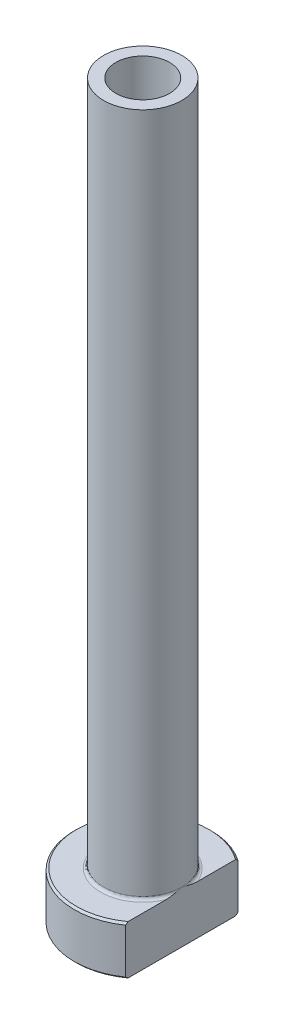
ISO-10303-21;
HEADER;
FILE_DESCRIPTION(('STEP AP214'),'2;1');
FILE_NAME('part.step','',(''),(''),'','','');
FILE_SCHEMA(('AUTOMOTIVE_DESIGN { 1 0 10303 214 1 1 1 1 }'));
ENDSEC;
DATA;
#1=APPLICATION_CONTEXT('core data for automotive mechanical design processes');
#2=APPLICATION_PROTOCOL_DEFINITION('international standard','automotive_design',2000,#1);
#3=PRODUCT_CONTEXT('',#1,'mechanical');
#4=PRODUCT('Part','Part','',(#3));
#5=PRODUCT_RELATED_PRODUCT_CATEGORY('part','',(#4));
#6=PRODUCT_DEFINITION_FORMATION('','',#4);
#7=PRODUCT_DEFINITION_CONTEXT('part definition',#1,'design');
#8=PRODUCT_DEFINITION('design','',#6,#7);
#9=PRODUCT_DEFINITION_SHAPE('','',#8);
#10=(LENGTH_UNIT() NAMED_UNIT(*) SI_UNIT(.MILLI.,.METRE.));
#11=(NAMED_UNIT(*) PLANE_ANGLE_UNIT() SI_UNIT($,.RADIAN.));
#12=(NAMED_UNIT(*) SI_UNIT($,.STERADIAN.) SOLID_ANGLE_UNIT());
#13=UNCERTAINTY_MEASURE_WITH_UNIT(LENGTH_MEASURE(1.E-05),#10,'distance_accuracy_value','');
#14=(GEOMETRIC_REPRESENTATION_CONTEXT(3) GLOBAL_UNCERTAINTY_ASSIGNED_CONTEXT((#13)) GLOBAL_UNIT_ASSIGNED_CONTEXT((#10,
#11,#12)) REPRESENTATION_CONTEXT('',''));
#15=CARTESIAN_POINT('',(0.,0.,0.));
#16=DIRECTION('',(0.,0.,1.));
#17=DIRECTION('',(1.,0.,0.));
#18=AXIS2_PLACEMENT_3D('',#15,#16,#17);
#19=CARTESIAN_POINT('',(0.,92.1876809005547,0.));
#20=DIRECTION('',(0.,1.,0.));
#21=DIRECTION('',(0.,0.,1.));
#22=AXIS2_PLACEMENT_3D('',#19,#20,#21);
#23=CYLINDRICAL_SURFACE('',#22,2.75000000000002);
#24=CARTESIAN_POINT('',(0.,75.,0.));
#25=DIRECTION('',(0.,1.,0.));
#26=DIRECTION('',(0.,0.,1.));
#27=AXIS2_PLACEMENT_3D('',#24,#25,#26);
#28=CIRCLE('',#27,2.75000000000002);
#29=CARTESIAN_POINT('',(0.,75.,2.75000000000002));
#30=VERTEX_POINT('',#29);
#31=EDGE_CURVE('E167',#30,#30,#28,.T.);
#32=ORIENTED_EDGE('',*,*,#31,.T.);
#33=EDGE_LOOP('',(#32));
#34=FACE_BOUND('',#33,.T.);
#35=CARTESIAN_POINT('',(0.,30.,0.));
#36=DIRECTION('',(0.,1.,0.));
#37=DIRECTION('',(0.,0.,1.));
#38=AXIS2_PLACEMENT_3D('',#35,#36,#37);
#39=CIRCLE('',#38,2.75000000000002);
#40=CARTESIAN_POINT('',(0.,30.,2.75000000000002));
#41=VERTEX_POINT('',#40);
#42=EDGE_CURVE('E170',#41,#41,#39,.T.);
#43=ORIENTED_EDGE('',*,*,#42,.F.);
#44=EDGE_LOOP('',(#43));
#45=FACE_BOUND('',#44,.T.);
#46=ADVANCED_FACE('F32',(#34,#45),#23,.F.);
#47=CARTESIAN_POINT('',(-2.75000000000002,75.,0.));
#48=DIRECTION('',(0.,1.,0.));
#49=DIRECTION('',(0.,0.,1.));
#50=AXIS2_PLACEMENT_3D('',#47,#48,#49);
#51=PLANE('',#50);
#52=CARTESIAN_POINT('',(0.,75.,0.));
#53=DIRECTION('',(0.,1.,0.));
#54=DIRECTION('',(0.,0.,1.));
#55=AXIS2_PLACEMENT_3D('',#52,#53,#54);
#56=CIRCLE('',#55,4.);
#57=CARTESIAN_POINT('',(0.,75.,4.));
#58=VERTEX_POINT('',#57);
#59=EDGE_CURVE('E174',#58,#58,#56,.T.);
#60=ORIENTED_EDGE('',*,*,#59,.T.);
#61=EDGE_LOOP('',(#60));
#62=FACE_BOUND('',#61,.T.);
#63=ORIENTED_EDGE('',*,*,#31,.F.);
#64=EDGE_LOOP('',(#63));
#65=FACE_BOUND('',#64,.T.);
#66=ADVANCED_FACE('F157',(#62,#65),#51,.T.);
#67=CARTESIAN_POINT('',(0.,92.1876809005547,0.));
#68=DIRECTION('',(0.,1.,0.));
#69=DIRECTION('',(0.,0.,1.));
#70=AXIS2_PLACEMENT_3D('',#67,#68,#69);
#71=CYLINDRICAL_SURFACE('',#70,3.99999999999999);
#72=CARTESIAN_POINT('',(0.,5.3,0.));
#73=DIRECTION('',(0.,1.,0.));
#74=DIRECTION('',(0.,0.,1.));
#75=AXIS2_PLACEMENT_3D('',#72,#73,#74);
#76=CIRCLE('',#75,3.99999999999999);
#77=CARTESIAN_POINT('',(3.99999999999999,5.3,0.));
#78=VERTEX_POINT('',#77);
#79=EDGE_CURVE('E180',#78,#78,#76,.T.);
#80=ORIENTED_EDGE('',*,*,#79,.T.);
#81=EDGE_LOOP('',(#80));
#82=FACE_BOUND('',#81,.T.);
#83=ORIENTED_EDGE('',*,*,#59,.F.);
#84=EDGE_LOOP('',(#83));
#85=FACE_BOUND('',#84,.T.);
#86=ADVANCED_FACE('F162',(#82,#85),#71,.T.);
#87=CARTESIAN_POINT('',(-3.99999999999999,5.,0.));
#88=DIRECTION('',(0.,1.,0.));
#89=DIRECTION('',(0.,0.,1.));
#90=AXIS2_PLACEMENT_3D('',#87,#88,#89);
#91=PLANE('',#90);
#92=DIRECTION('',(0.,0.,1.));
#93=VECTOR('',#92,1.);
#94=CARTESIAN_POINT('',(4.,5.,0.));
#95=LINE('',#94,#93);
#96=CARTESIAN_POINT('',(4.,5.,-5.49909083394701));
#97=VERTEX_POINT('',#96);
#98=CARTESIAN_POINT('',(4.,5.,-1.57797338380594));
#99=VERTEX_POINT('',#98);
#100=EDGE_CURVE('E54',#97,#99,#95,.T.);
#101=ORIENTED_EDGE('',*,*,#100,.F.);
#102=CARTESIAN_POINT('',(0.,5.,0.));
#103=DIRECTION('',(0.,1.,0.));
#104=DIRECTION('',(0.,0.,1.));
#105=AXIS2_PLACEMENT_3D('',#102,#103,#104);
#106=CIRCLE('',#105,6.8);
#107=CARTESIAN_POINT('',(3.99999999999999,5.,5.49909083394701));
#108=VERTEX_POINT('',#107);
#109=EDGE_CURVE('E186',#97,#108,#106,.T.);
#110=ORIENTED_EDGE('',*,*,#109,.T.);
#111=CARTESIAN_POINT('',(4.,5.,1.57797338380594));
#112=VERTEX_POINT('',#111);
#113=EDGE_CURVE('E134',#112,#108,#95,.T.);
#114=ORIENTED_EDGE('',*,*,#113,.F.);
#115=CARTESIAN_POINT('',(0.,5.,0.));
#116=DIRECTION('',(0.,1.,0.));
#117=DIRECTION('',(0.,0.,1.));
#118=AXIS2_PLACEMENT_3D('',#115,#116,#117);
#119=CIRCLE('',#118,4.29999999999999);
#120=EDGE_CURVE('E183',#112,#99,#119,.F.);
#121=ORIENTED_EDGE('',*,*,#120,.T.);
#122=EDGE_LOOP('',(#101,#110,#114,#121));
#123=FACE_BOUND('',#122,.T.);
#124=ADVANCED_FACE('F197',(#123),#91,.T.);
#125=CARTESIAN_POINT('',(0.,92.1876809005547,0.));
#126=DIRECTION('',(0.,1.,0.));
#127=DIRECTION('',(0.,0.,1.));
#128=AXIS2_PLACEMENT_3D('',#125,#126,#127);
#129=CYLINDRICAL_SURFACE('',#128,6.99999999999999);
#130=DIRECTION('',(0.,-1.,0.));
#131=VECTOR('',#130,1.);
#132=CARTESIAN_POINT('',(3.99999999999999,75.,5.74456264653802));
#133=LINE('',#132,#131);
#134=CARTESIAN_POINT('',(3.99999999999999,4.8,5.74456264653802));
#135=VERTEX_POINT('',#134);
#136=CARTESIAN_POINT('',(3.99999999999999,0.199999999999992,5.74456264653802));
#137=VERTEX_POINT('',#136);
#138=EDGE_CURVE('E82',#135,#137,#133,.T.);
#139=ORIENTED_EDGE('',*,*,#138,.F.);
#140=CARTESIAN_POINT('',(0.,4.8,0.));
#141=DIRECTION('',(0.,1.,0.));
#142=DIRECTION('',(0.,0.,1.));
#143=AXIS2_PLACEMENT_3D('',#140,#141,#142);
#144=CIRCLE('',#143,6.99999999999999);
#145=CARTESIAN_POINT('',(4.,4.8,-5.74456264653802));
#146=VERTEX_POINT('',#145);
#147=EDGE_CURVE('E95',#135,#146,#144,.F.);
#148=ORIENTED_EDGE('',*,*,#147,.T.);
#149=DIRECTION('',(0.,-1.,0.));
#150=VECTOR('',#149,1.);
#151=CARTESIAN_POINT('',(4.,75.,-5.74456264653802));
#152=LINE('',#151,#150);
#153=CARTESIAN_POINT('',(4.,0.199999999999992,-5.74456264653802));
#154=VERTEX_POINT('',#153);
#155=EDGE_CURVE('E192',#146,#154,#152,.T.);
#156=ORIENTED_EDGE('',*,*,#155,.T.);
#157=CARTESIAN_POINT('',(0.,0.199999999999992,0.));
#158=DIRECTION('',(0.,-1.,0.));
#159=DIRECTION('',(0.,0.,-1.));
#160=AXIS2_PLACEMENT_3D('',#157,#158,#159);
#161=CIRCLE('',#160,6.99999999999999);
#162=EDGE_CURVE('E98',#154,#137,#161,.F.);
#163=ORIENTED_EDGE('',*,*,#162,.T.);
#164=EDGE_LOOP('',(#139,#148,#156,#163));
#165=FACE_BOUND('',#164,.T.);
#166=ADVANCED_FACE('F190',(#165),#129,.T.);
#167=CARTESIAN_POINT('',(-6.99999999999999,0.,0.));
#168=DIRECTION('',(0.,-1.,0.));
#169=DIRECTION('',(0.,0.,-1.));
#170=AXIS2_PLACEMENT_3D('',#167,#168,#169);
#171=PLANE('',#170);
#172=CARTESIAN_POINT('',(0.,0.,0.));
#173=DIRECTION('',(0.,-1.,0.));
#174=DIRECTION('',(0.,0.,-1.));
#175=AXIS2_PLACEMENT_3D('',#172,#173,#174);
#176=CIRCLE('',#175,3.49999999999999);
#177=CARTESIAN_POINT('',(0.,0.,-3.49999999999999));
#178=VERTEX_POINT('',#177);
#179=EDGE_CURVE('E40',#178,#178,#176,.F.);
#180=ORIENTED_EDGE('',*,*,#179,.T.);
#181=EDGE_LOOP('',(#180));
#182=FACE_BOUND('',#181,.T.);
#183=DIRECTION('',(0.,0.,-1.));
#184=VECTOR('',#183,1.);
#185=CARTESIAN_POINT('',(3.99999999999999,0.,5.74456264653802));
#186=LINE('',#185,#184);
#187=CARTESIAN_POINT('',(3.99999999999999,0.,5.49909083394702));
#188=VERTEX_POINT('',#187);
#189=CARTESIAN_POINT('',(4.,0.,-5.49909083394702));
#190=VERTEX_POINT('',#189);
#191=EDGE_CURVE('E47',#188,#190,#186,.T.);
#192=ORIENTED_EDGE('',*,*,#191,.F.);
#193=CARTESIAN_POINT('',(0.,0.,0.));
#194=DIRECTION('',(0.,-1.,0.));
#195=DIRECTION('',(0.,0.,-1.));
#196=AXIS2_PLACEMENT_3D('',#193,#194,#195);
#197=CIRCLE('',#196,6.80000000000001);
#198=EDGE_CURVE('E92',#188,#190,#197,.T.);
#199=ORIENTED_EDGE('',*,*,#198,.T.);
#200=EDGE_LOOP('',(#192,#199));
#201=FACE_BOUND('',#200,.T.);
#202=ADVANCED_FACE('F91',(#182,#201),#171,.T.);
#203=CARTESIAN_POINT('',(0.,92.1876809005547,0.));
#204=DIRECTION('',(0.,1.,0.));
#205=DIRECTION('',(0.,0.,1.));
#206=AXIS2_PLACEMENT_3D('',#203,#204,#205);
#207=CYLINDRICAL_SURFACE('',#206,2.99999999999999);
#208=CARTESIAN_POINT('',(0.,0.5,0.));
#209=DIRECTION('',(0.,-1.,0.));
#210=DIRECTION('',(0.,0.,-1.));
#211=AXIS2_PLACEMENT_3D('',#208,#209,#210);
#212=CIRCLE('',#211,2.99999999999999);
#213=CARTESIAN_POINT('',(0.,0.5,-2.99999999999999));
#214=VERTEX_POINT('',#213);
#215=EDGE_CURVE('E11',#214,#214,#212,.T.);
#216=ORIENTED_EDGE('',*,*,#215,.T.);
#217=EDGE_LOOP('',(#216));
#218=FACE_BOUND('',#217,.T.);
#219=CARTESIAN_POINT('',(0.,18.,0.));
#220=DIRECTION('',(0.,1.,0.));
#221=DIRECTION('',(0.,0.,1.));
#222=AXIS2_PLACEMENT_3D('',#219,#220,#221);
#223=CIRCLE('',#222,2.99999999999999);
#224=CARTESIAN_POINT('',(0.,18.,2.99999999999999));
#225=VERTEX_POINT('',#224);
#226=EDGE_CURVE('E172',#225,#225,#223,.T.);
#227=ORIENTED_EDGE('',*,*,#226,.T.);
#228=EDGE_LOOP('',(#227));
#229=FACE_BOUND('',#228,.T.);
#230=ADVANCED_FACE('F215',(#218,#229),#207,.F.);
#231=CARTESIAN_POINT('',(0.,18.,0.));
#232=DIRECTION('',(0.,-1.,0.));
#233=DIRECTION('',(0.,0.,-1.));
#234=AXIS2_PLACEMENT_3D('',#231,#232,#233);
#235=CONICAL_SURFACE('',#234,2.99999999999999,0.0208303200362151);
#236=ORIENTED_EDGE('',*,*,#42,.T.);
#237=EDGE_LOOP('',(#236));
#238=FACE_BOUND('',#237,.T.);
#239=ORIENTED_EDGE('',*,*,#226,.F.);
#240=EDGE_LOOP('',(#239));
#241=FACE_BOUND('',#240,.T.);
#242=ADVANCED_FACE('F111',(#238,#241),#235,.F.);
#243=CARTESIAN_POINT('',(0.,5.3,0.));
#244=DIRECTION('',(0.,1.,0.));
#245=DIRECTION('',(0.,0.,1.));
#246=AXIS2_PLACEMENT_3D('',#243,#244,#245);
#247=TOROIDAL_SURFACE('',#246,4.29999999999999,0.3);
#248=ORIENTED_EDGE('',*,*,#120,.F.);
#249=CARTESIAN_POINT('',(3.99999999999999,5.3,0.));
#250=CARTESIAN_POINT('',(3.99999999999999,5.30000062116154,-1.06250692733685E-10));
#251=CARTESIAN_POINT('',(3.99999999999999,5.30000124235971,2.17725991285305E-07));
#252=CARTESIAN_POINT('',(3.99999999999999,5.30000240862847,8.36140834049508E-07));
#253=CARTESIAN_POINT('',(3.99999999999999,5.30000294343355,1.2501166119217E-06));
#254=CARTESIAN_POINT('',(3.99999999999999,5.3000040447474,2.23959309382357E-06));
#255=CARTESIAN_POINT('',(3.99999999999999,5.30000459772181,2.83084427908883E-06));
#256=CARTESIAN_POINT('',(3.99999999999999,5.30000559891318,4.06516564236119E-06));
#257=CARTESIAN_POINT('',(3.99999999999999,5.30000604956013,4.70640046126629E-06));
#258=CARTESIAN_POINT('',(3.99999999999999,5.30000769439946,7.15677144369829E-06));
#259=CARTESIAN_POINT('',(3.99999999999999,5.3000087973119,9.02995892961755E-06));
#260=CARTESIAN_POINT('',(3.99999999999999,5.30001063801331,1.27664878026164E-05));
#261=CARTESIAN_POINT('',(3.99999999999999,5.30001139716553,1.46197798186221E-05));
#262=CARTESIAN_POINT('',(3.99999999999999,5.3000145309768,2.23679207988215E-05));
#263=CARTESIAN_POINT('',(3.99999999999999,5.30001683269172,2.82968730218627E-05));
#264=CARTESIAN_POINT('',(3.99999999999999,5.30002027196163,3.95668707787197E-05));
#265=CARTESIAN_POINT('',(3.99999999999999,5.30002152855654,4.48715441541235E-05));
#266=CARTESIAN_POINT('',(3.99999999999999,5.30003060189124,8.40118167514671E-05));
#267=CARTESIAN_POINT('',(4.,5.30003739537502,0.000118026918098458));
#268=CARTESIAN_POINT('',(4.,5.30006713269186,0.000252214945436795));
#269=CARTESIAN_POINT('',(4.,5.30009559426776,0.000351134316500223));
#270=CARTESIAN_POINT('',(3.99999999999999,5.30020622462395,0.000742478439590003));
#271=CARTESIAN_POINT('',(3.99999999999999,5.30028475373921,0.00103561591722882));
#272=CARTESIAN_POINT('',(4.,5.3005988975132,0.0021992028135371));
#273=CARTESIAN_POINT('',(4.,5.30083905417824,0.0030687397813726));
#274=CARTESIAN_POINT('',(3.99999999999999,5.30183682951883,0.00669141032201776));
#275=CARTESIAN_POINT('',(3.99999999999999,5.30258877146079,0.00944568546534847));
#276=CARTESIAN_POINT('',(4.,5.31066890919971,0.0390293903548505));
#277=CARTESIAN_POINT('',(4.,5.31802631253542,0.0658531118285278));
#278=CARTESIAN_POINT('',(3.99999999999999,5.33239676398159,0.118441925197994));
#279=CARTESIAN_POINT('',(3.99999999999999,5.33941183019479,0.14420651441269));
#280=CARTESIAN_POINT('',(4.,5.35427366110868,0.199017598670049));
#281=CARTESIAN_POINT('',(4.,5.36211313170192,0.228066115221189));
#282=CARTESIAN_POINT('',(4.,5.37776349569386,0.28651184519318));
#283=CARTESIAN_POINT('',(4.,5.38557313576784,0.315909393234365));
#284=CARTESIAN_POINT('',(4.,5.40425662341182,0.386994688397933));
#285=CARTESIAN_POINT('',(4.,5.41505237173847,0.428703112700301));
#286=CARTESIAN_POINT('',(4.,5.43592310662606,0.511098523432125));
#287=CARTESIAN_POINT('',(4.,5.44600969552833,0.551782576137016));
#288=CARTESIAN_POINT('',(4.,5.47850986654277,0.686599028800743));
#289=CARTESIAN_POINT('',(4.,5.49978370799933,0.781011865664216));
#290=CARTESIAN_POINT('',(4.,5.53807543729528,0.971847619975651));
#291=CARTESIAN_POINT('',(4.,5.55504273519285,1.06828120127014));
#292=CARTESIAN_POINT('',(4.,5.57582405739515,1.21752725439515));
#293=CARTESIAN_POINT('',(4.,5.58209796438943,1.26999379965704));
#294=CARTESIAN_POINT('',(4.,5.59210686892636,1.37516324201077));
#295=CARTESIAN_POINT('',(4.,5.59584265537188,1.42786606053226));
#296=CARTESIAN_POINT('',(4.,5.60010438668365,1.53310673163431));
#297=CARTESIAN_POINT('',(4.,5.6006487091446,1.58564378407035));
#298=CARTESIAN_POINT('',(4.,5.59767158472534,1.69058605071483));
#299=CARTESIAN_POINT('',(4.,5.59415502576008,1.74299134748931));
#300=CARTESIAN_POINT('',(4.,5.58503062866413,1.8190329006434));
#301=CARTESIAN_POINT('',(4.,5.58157617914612,1.84292934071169));
#302=CARTESIAN_POINT('',(4.,5.5732995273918,1.89051061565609));
#303=CARTESIAN_POINT('',(4.,5.56847619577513,1.91419525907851));
#304=CARTESIAN_POINT('',(4.,5.55726644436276,1.96092888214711));
#305=CARTESIAN_POINT('',(4.,5.55089740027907,1.98398195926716));
#306=CARTESIAN_POINT('',(4.,5.53623434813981,2.0294555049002));
#307=CARTESIAN_POINT('',(4.,5.52794253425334,2.05187666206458));
#308=CARTESIAN_POINT('',(4.,5.50887098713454,2.09590631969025));
#309=CARTESIAN_POINT('',(4.,5.49806837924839,2.1175050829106));
#310=CARTESIAN_POINT('',(4.,5.47333401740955,2.15885583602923));
#311=CARTESIAN_POINT('',(4.,5.45941272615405,2.17861369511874));
#312=CARTESIAN_POINT('',(4.,5.43588221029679,2.20522942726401));
#313=CARTESIAN_POINT('',(4.,5.42781139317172,2.21344043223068));
#314=CARTESIAN_POINT('',(4.,5.41065114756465,2.22875149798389));
#315=CARTESIAN_POINT('',(4.,5.40156129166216,2.23585108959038));
#316=CARTESIAN_POINT('',(4.,5.38220524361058,2.24859694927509));
#317=CARTESIAN_POINT('',(4.,5.37192420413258,2.25422119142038));
#318=CARTESIAN_POINT('',(4.,5.35045072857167,2.26331064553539));
#319=CARTESIAN_POINT('',(4.,5.33926122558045,2.26678251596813));
#320=CARTESIAN_POINT('',(4.,5.31952044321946,2.27051268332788));
#321=CARTESIAN_POINT('',(4.,5.31108453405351,2.27139016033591));
#322=CARTESIAN_POINT('',(4.,5.29418624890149,2.2716896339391));
#323=CARTESIAN_POINT('',(4.,5.28572387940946,2.27111196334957));
#324=CARTESIAN_POINT('',(4.,5.26904138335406,2.26855580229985));
#325=CARTESIAN_POINT('',(4.,5.26082066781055,2.26658107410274));
#326=CARTESIAN_POINT('',(4.,5.24478214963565,2.26139496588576));
#327=CARTESIAN_POINT('',(4.,5.23696461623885,2.25818277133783));
#328=CARTESIAN_POINT('',(4.,5.21851235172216,2.24908332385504));
#329=CARTESIAN_POINT('',(4.,5.20815219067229,2.24264095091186));
#330=CARTESIAN_POINT('',(4.,5.18857975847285,2.22819957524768));
#331=CARTESIAN_POINT('',(4.,5.17937061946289,2.22019647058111));
#332=CARTESIAN_POINT('',(4.,5.15665383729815,2.19777756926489));
#333=CARTESIAN_POINT('',(4.,5.14403484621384,2.18246908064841));
#334=CARTESIAN_POINT('',(4.,5.12118369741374,2.15020843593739));
#335=CARTESIAN_POINT('',(4.,5.11095480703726,2.13325407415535));
#336=CARTESIAN_POINT('',(4.,5.09273574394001,2.09892324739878));
#337=CARTESIAN_POINT('',(4.,5.08468212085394,2.08157988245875));
#338=CARTESIAN_POINT('',(4.,5.07005901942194,2.04627072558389));
#339=CARTESIAN_POINT('',(4.,5.06349101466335,2.02830433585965));
#340=CARTESIAN_POINT('',(4.,5.04555485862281,1.97350761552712));
#341=CARTESIAN_POINT('',(4.,5.03608974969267,1.93605770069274));
#342=CARTESIAN_POINT('',(4.,5.0178056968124,1.8452923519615));
#343=CARTESIAN_POINT('',(4.,5.01077018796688,1.79164082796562));
#344=CARTESIAN_POINT('',(4.,5.00182846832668,1.6837994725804));
#345=CARTESIAN_POINT('',(4.,4.99993887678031,1.62960846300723));
#346=CARTESIAN_POINT('',(4.,5.00006129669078,1.52361204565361));
#347=CARTESIAN_POINT('',(4.,5.00190698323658,1.4718055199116));
#348=CARTESIAN_POINT('',(4.,5.00841243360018,1.36835357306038));
#349=CARTESIAN_POINT('',(4.,5.01307376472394,1.31670825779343));
#350=CARTESIAN_POINT('',(4.,5.02905484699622,1.17431887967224));
#351=CARTESIAN_POINT('',(4.,5.04274090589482,1.08384207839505));
#352=CARTESIAN_POINT('',(4.,5.06701714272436,0.947757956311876));
#353=CARTESIAN_POINT('',(4.,5.07585573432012,0.901814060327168));
#354=CARTESIAN_POINT('',(4.,5.09458665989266,0.810008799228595));
#355=CARTESIAN_POINT('',(4.,5.10448180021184,0.764148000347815));
#356=CARTESIAN_POINT('',(4.,5.1289243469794,0.655631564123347));
#357=CARTESIAN_POINT('',(4.,5.14383556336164,0.593058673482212));
#358=CARTESIAN_POINT('',(4.,5.17458762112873,0.468885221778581));
#359=CARTESIAN_POINT('',(4.,5.19041623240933,0.407281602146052));
#360=CARTESIAN_POINT('',(3.99999999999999,5.22090834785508,0.291232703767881));
#361=CARTESIAN_POINT('',(3.99999999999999,5.23550024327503,0.236768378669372));
#362=CARTESIAN_POINT('',(4.,5.26562550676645,0.125604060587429));
#363=CARTESIAN_POINT('',(4.00000000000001,5.28117250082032,0.0689076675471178));
#364=CARTESIAN_POINT('',(3.99999999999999,5.29741226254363,0.00944154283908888));
#365=CARTESIAN_POINT('',(3.99999999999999,5.29816540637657,0.00668315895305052));
#366=CARTESIAN_POINT('',(4.,5.29916346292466,0.00305954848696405));
#367=CARTESIAN_POINT('',(4.,5.29940273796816,0.00219318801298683));
#368=CARTESIAN_POINT('',(3.99999999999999,5.29971580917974,0.00103357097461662));
#369=CARTESIAN_POINT('',(3.99999999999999,5.29979412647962,0.000741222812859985));
#370=CARTESIAN_POINT('',(4.,5.29990450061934,0.00035080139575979));
#371=CARTESIAN_POINT('',(4.,5.29993292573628,0.00025201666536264));
#372=CARTESIAN_POINT('',(4.,5.2999626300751,0.000117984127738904));
#373=CARTESIAN_POINT('',(3.99999999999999,5.29996941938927,8.39881851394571E-05));
#374=CARTESIAN_POINT('',(3.99999999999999,5.29997848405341,4.48673984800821E-05));
#375=CARTESIAN_POINT('',(3.99999999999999,5.29997973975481,3.95638156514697E-05));
#376=CARTESIAN_POINT('',(3.99999999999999,5.29998317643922,2.82960308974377E-05));
#377=CARTESIAN_POINT('',(3.99999999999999,5.29998547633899,2.236814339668E-05));
#378=CARTESIAN_POINT('',(3.99999999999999,5.29998860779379,1.46210987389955E-05));
#379=CARTESIAN_POINT('',(3.99999999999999,5.29998936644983,1.27678884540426E-05));
#380=CARTESIAN_POINT('',(3.99999999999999,5.29999120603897,9.03143915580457E-06));
#381=CARTESIAN_POINT('',(3.99999999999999,5.29999230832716,7.1582397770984E-06));
#382=CARTESIAN_POINT('',(3.99999999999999,5.29999395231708,4.70775453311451E-06));
#383=CARTESIAN_POINT('',(3.99999999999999,5.29999440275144,4.06646315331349E-06));
#384=CARTESIAN_POINT('',(3.99999999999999,5.2999954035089,2.83199030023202E-06));
#385=CARTESIAN_POINT('',(3.99999999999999,5.29999595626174,2.24064296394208E-06));
#386=CARTESIAN_POINT('',(3.99999999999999,5.29999705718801,1.25093940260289E-06));
#387=CARTESIAN_POINT('',(3.99999999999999,5.29999759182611,8.36840805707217E-07));
#388=CARTESIAN_POINT('',(3.99999999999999,5.29999875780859,2.18117629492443E-07));
#389=CARTESIAN_POINT('',(3.99999999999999,5.29999937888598,1.06243770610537E-10));
#390=CARTESIAN_POINT('',(3.99999999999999,5.3,0.));
#391=B_SPLINE_CURVE_WITH_KNOTS('',3,(#249,#250,#251,#252,#253,#254,#255,#256,#257,#258,#259,
#260,#261,#262,#263,#264,#265,#266,#267,#268,#269,#270,#271,#272,#273,#274,#275,#276,#277,#278,
#279,#280,#281,#282,#283,#284,#285,#286,#287,#288,#289,#290,#291,#292,#293,#294,#295,#296,#297,
#298,#299,#300,#301,#302,#303,#304,#305,#306,#307,#308,#309,#310,#311,#312,#313,#314,#315,#316,
#317,#318,#319,#320,#321,#322,#323,#324,#325,#326,#327,#328,#329,#330,#331,#332,#333,#334,#335,
#336,#337,#338,#339,#340,#341,#342,#343,#344,#345,#346,#347,#348,#349,#350,#351,#352,#353,#354,
#355,#356,#357,#358,#359,#360,#361,#362,#363,#364,#365,#366,#367,#368,#369,#370,#371,#372,#373,
#374,#375,#376,#377,#378,#379,#380,#381,#382,#383,#384,#385,#386,#387,#388,#389,#390),
.UNSPECIFIED.,.T.,.F.,(4,2,2,2,2,2,2,2,2,2,2,2,2,2,2,2,2,2,2,2,2,2,2,2,2,2,2,2,2,2,2,2,2,2,2,2,
2,2,2,2,2,2,2,2,2,2,2,2,2,2,2,2,2,2,2,2,2,2,2,2,2,2,2,2,2,2,2,2,2,2,4),(0.,1.87484564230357E-06,
3.9018029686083E-06,6.31684198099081E-06,8.66652435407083E-06,1.51627608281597E-05,
2.11658001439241E-05,4.02090842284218E-05,5.65429557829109E-05,0.000160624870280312,
0.000469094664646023,0.00137985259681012,0.00408571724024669,0.0126514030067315,
0.0960918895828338,0.176200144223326,0.266463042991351,0.357714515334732,0.48696124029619,
0.612707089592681,0.902988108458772,1.19653589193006,1.35501075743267,1.51343634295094,
1.6709487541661,1.82827177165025,1.90067591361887,1.97313996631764,2.04482437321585,
2.11642737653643,2.188710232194,2.2607541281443,2.29521947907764,2.32969934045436,
2.36466792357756,2.39952778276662,2.42485422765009,2.45017488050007,2.47542760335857,
2.50069697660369,2.53708899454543,2.57357798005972,2.63276032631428,2.69202310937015,
2.74930315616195,2.80663977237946,2.92223125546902,3.08420752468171,3.24670629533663,
3.40212850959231,3.55763731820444,3.83192962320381,3.9722838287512,4.11302057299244,
4.3059813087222,4.49678885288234,4.66594443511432,4.84230602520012,4.85088453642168,
4.85358051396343,4.8544888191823,4.85479687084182,4.85490089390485,4.85491722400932,
4.85493626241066,4.85494226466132,4.85494875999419,4.85495110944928,4.85495352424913,
4.85495555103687,4.85495742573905),.UNSPECIFIED.);
#392=EDGE_CURVE('E126',#112,#78,#391,.T.);
#393=ORIENTED_EDGE('',*,*,#392,.T.);
#394=ORIENTED_EDGE('',*,*,#79,.F.);
#395=CARTESIAN_POINT('',(3.99999999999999,5.3,0.));
#396=CARTESIAN_POINT('',(3.99999999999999,5.29999937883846,1.0625180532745E-10));
#397=CARTESIAN_POINT('',(3.99999999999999,5.29999875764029,-2.17725990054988E-07));
#398=CARTESIAN_POINT('',(3.99999999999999,5.29999759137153,-8.36140832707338E-07));
#399=CARTESIAN_POINT('',(3.99999999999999,5.29999705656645,-1.25011661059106E-06));
#400=CARTESIAN_POINT('',(3.99999999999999,5.2999959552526,-2.23959309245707E-06));
#401=CARTESIAN_POINT('',(3.99999999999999,5.29999540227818,-2.83084427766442E-06));
#402=CARTESIAN_POINT('',(3.99999999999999,5.29999440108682,-4.06516564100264E-06));
#403=CARTESIAN_POINT('',(3.99999999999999,5.29999395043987,-4.70640046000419E-06));
#404=CARTESIAN_POINT('',(3.99999999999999,5.29999230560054,-7.15677144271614E-06));
#405=CARTESIAN_POINT('',(3.99999999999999,5.2999912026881,-9.02995892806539E-06));
#406=CARTESIAN_POINT('',(3.99999999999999,5.29998936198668,-1.27664878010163E-05));
#407=CARTESIAN_POINT('',(3.99999999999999,5.29998860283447,-1.46197798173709E-05));
#408=CARTESIAN_POINT('',(3.99999999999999,5.2999854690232,-2.23679207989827E-05));
#409=CARTESIAN_POINT('',(3.99999999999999,5.29998316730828,-2.82968730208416E-05));
#410=CARTESIAN_POINT('',(3.99999999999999,5.29997972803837,-3.95668707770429E-05));
#411=CARTESIAN_POINT('',(3.99999999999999,5.29997847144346,-4.48715441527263E-05));
#412=CARTESIAN_POINT('',(3.99999999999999,5.29996939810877,-8.40118167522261E-05));
#413=CARTESIAN_POINT('',(4.,5.29996260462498,-0.000118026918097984));
#414=CARTESIAN_POINT('',(4.,5.29993286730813,-0.000252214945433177));
#415=CARTESIAN_POINT('',(4.,5.29990440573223,-0.000351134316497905));
#416=CARTESIAN_POINT('',(3.99999999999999,5.29979377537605,-0.000742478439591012));
#417=CARTESIAN_POINT('',(3.99999999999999,5.29971524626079,-0.00103561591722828));
#418=CARTESIAN_POINT('',(4.,5.29940110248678,-0.00219920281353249));
#419=CARTESIAN_POINT('',(4.,5.29916094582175,-0.00306873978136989));
#420=CARTESIAN_POINT('',(3.99999999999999,5.29816317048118,-0.00669141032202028));
#421=CARTESIAN_POINT('',(3.99999999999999,5.29741122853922,-0.00944568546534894));
#422=CARTESIAN_POINT('',(4.,5.28933109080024,-0.0390293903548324));
#423=CARTESIAN_POINT('',(4.,5.28197368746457,-0.0658531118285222));
#424=CARTESIAN_POINT('',(3.99999999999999,5.26760323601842,-0.118441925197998));
#425=CARTESIAN_POINT('',(3.99999999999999,5.26058816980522,-0.144206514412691));
#426=CARTESIAN_POINT('',(4.,5.24572633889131,-0.199017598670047));
#427=CARTESIAN_POINT('',(4.,5.23788686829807,-0.228066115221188));
#428=CARTESIAN_POINT('',(4.,5.22223650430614,-0.28651184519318));
#429=CARTESIAN_POINT('',(4.,5.21442686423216,-0.315909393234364));
#430=CARTESIAN_POINT('',(4.,5.19574337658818,-0.386994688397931));
#431=CARTESIAN_POINT('',(4.,5.18494762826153,-0.428703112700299));
#432=CARTESIAN_POINT('',(4.,5.16407689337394,-0.511098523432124));
#433=CARTESIAN_POINT('',(4.,5.15399030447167,-0.551782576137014));
#434=CARTESIAN_POINT('',(4.,5.12149013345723,-0.68659902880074));
#435=CARTESIAN_POINT('',(4.,5.10021629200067,-0.781011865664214));
#436=CARTESIAN_POINT('',(4.,5.06192456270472,-0.97184761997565));
#437=CARTESIAN_POINT('',(4.,5.04495726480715,-1.06828120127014));
#438=CARTESIAN_POINT('',(4.,5.02417594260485,-1.21752725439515));
#439=CARTESIAN_POINT('',(4.,5.01790203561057,-1.26999379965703));
#440=CARTESIAN_POINT('',(4.,5.00789313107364,-1.37516324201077));
#441=CARTESIAN_POINT('',(4.,5.00415734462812,-1.42786606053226));
#442=CARTESIAN_POINT('',(4.,4.99989561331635,-1.5331067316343));
#443=CARTESIAN_POINT('',(4.,4.9993512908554,-1.58564378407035));
#444=CARTESIAN_POINT('',(4.,5.00232841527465,-1.69058605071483));
#445=CARTESIAN_POINT('',(4.,5.00584497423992,-1.74299134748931));
#446=CARTESIAN_POINT('',(4.,5.01496937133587,-1.8190329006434));
#447=CARTESIAN_POINT('',(4.,5.01842382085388,-1.84292934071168));
#448=CARTESIAN_POINT('',(4.,5.0267004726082,-1.89051061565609));
#449=CARTESIAN_POINT('',(4.,5.03152380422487,-1.9141952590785));
#450=CARTESIAN_POINT('',(4.,5.04273355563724,-1.96092888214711));
#451=CARTESIAN_POINT('',(4.,5.04910259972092,-1.98398195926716));
#452=CARTESIAN_POINT('',(4.,5.06376565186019,-2.0294555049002));
#453=CARTESIAN_POINT('',(4.,5.07205746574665,-2.05187666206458));
#454=CARTESIAN_POINT('',(4.,5.09112901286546,-2.09590631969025));
#455=CARTESIAN_POINT('',(4.,5.10193162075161,-2.1175050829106));
#456=CARTESIAN_POINT('',(4.,5.12666598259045,-2.15885583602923));
#457=CARTESIAN_POINT('',(4.,5.14058727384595,-2.17861369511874));
#458=CARTESIAN_POINT('',(4.,5.16411778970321,-2.20522942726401));
#459=CARTESIAN_POINT('',(4.,5.17218860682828,-2.21344043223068));
#460=CARTESIAN_POINT('',(4.,5.18934885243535,-2.22875149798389));
#461=CARTESIAN_POINT('',(4.,5.19843870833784,-2.23585108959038));
#462=CARTESIAN_POINT('',(4.,5.21779475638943,-2.24859694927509));
#463=CARTESIAN_POINT('',(4.,5.22807579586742,-2.25422119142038));
#464=CARTESIAN_POINT('',(4.,5.24954927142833,-2.26331064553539));
#465=CARTESIAN_POINT('',(4.,5.26073877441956,-2.26678251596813));
#466=CARTESIAN_POINT('',(4.,5.28047955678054,-2.27051268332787));
#467=CARTESIAN_POINT('',(4.,5.28891546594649,-2.27139016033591));
#468=CARTESIAN_POINT('',(4.,5.30581375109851,-2.2716896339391));
#469=CARTESIAN_POINT('',(4.,5.31427612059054,-2.27111196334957));
#470=CARTESIAN_POINT('',(4.,5.33095861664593,-2.26855580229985));
#471=CARTESIAN_POINT('',(4.,5.33917933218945,-2.26658107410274));
#472=CARTESIAN_POINT('',(4.,5.35521785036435,-2.26139496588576));
#473=CARTESIAN_POINT('',(4.,5.36303538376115,-2.25818277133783));
#474=CARTESIAN_POINT('',(4.,5.38148764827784,-2.24908332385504));
#475=CARTESIAN_POINT('',(4.,5.3918478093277,-2.24264095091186));
#476=CARTESIAN_POINT('',(4.,5.41142024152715,-2.22819957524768));
#477=CARTESIAN_POINT('',(4.,5.4206293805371,-2.22019647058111));
#478=CARTESIAN_POINT('',(4.,5.44334616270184,-2.19777756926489));
#479=CARTESIAN_POINT('',(4.,5.45596515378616,-2.18246908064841));
#480=CARTESIAN_POINT('',(4.,5.47881630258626,-2.15020843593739));
#481=CARTESIAN_POINT('',(4.,5.48904519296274,-2.13325407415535));
#482=CARTESIAN_POINT('',(4.,5.50726425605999,-2.09892324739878));
#483=CARTESIAN_POINT('',(4.,5.51531787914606,-2.08157988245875));
#484=CARTESIAN_POINT('',(4.,5.52994098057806,-2.04627072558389));
#485=CARTESIAN_POINT('',(4.,5.53650898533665,-2.02830433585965));
#486=CARTESIAN_POINT('',(4.,5.55444514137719,-1.97350761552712));
#487=CARTESIAN_POINT('',(4.,5.56391025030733,-1.93605770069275));
#488=CARTESIAN_POINT('',(4.,5.5821943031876,-1.8452923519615));
#489=CARTESIAN_POINT('',(4.,5.58922981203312,-1.79164082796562));
#490=CARTESIAN_POINT('',(4.,5.59817153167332,-1.6837994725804));
#491=CARTESIAN_POINT('',(4.,5.60006112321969,-1.62960846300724));
#492=CARTESIAN_POINT('',(4.,5.59993870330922,-1.52361204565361));
#493=CARTESIAN_POINT('',(4.,5.59809301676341,-1.47180551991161));
#494=CARTESIAN_POINT('',(4.,5.59158756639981,-1.36835357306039));
#495=CARTESIAN_POINT('',(4.,5.58692623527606,-1.31670825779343));
#496=CARTESIAN_POINT('',(4.,5.57094515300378,-1.17431887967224));
#497=CARTESIAN_POINT('',(4.,5.55725909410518,-1.08384207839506));
#498=CARTESIAN_POINT('',(4.,5.53298285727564,-0.947757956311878));
#499=CARTESIAN_POINT('',(4.,5.52414426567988,-0.901814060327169));
#500=CARTESIAN_POINT('',(4.,5.50541334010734,-0.810008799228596));
#501=CARTESIAN_POINT('',(4.,5.49551819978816,-0.764148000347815));
#502=CARTESIAN_POINT('',(4.,5.4710756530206,-0.655631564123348));
#503=CARTESIAN_POINT('',(4.,5.45616443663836,-0.593058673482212));
#504=CARTESIAN_POINT('',(4.,5.42541237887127,-0.468885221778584));
#505=CARTESIAN_POINT('',(4.,5.40958376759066,-0.407281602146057));
#506=CARTESIAN_POINT('',(3.99999999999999,5.37909165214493,-0.29123270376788));
#507=CARTESIAN_POINT('',(3.99999999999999,5.364499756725,-0.236768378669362));
#508=CARTESIAN_POINT('',(4.,5.33437449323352,-0.125604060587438));
#509=CARTESIAN_POINT('',(4.00000000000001,5.31882749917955,-0.0689076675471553));
#510=CARTESIAN_POINT('',(3.99999999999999,5.30258773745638,-0.00944154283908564));
#511=CARTESIAN_POINT('',(3.99999999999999,5.30183459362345,-0.00668315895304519));
#512=CARTESIAN_POINT('',(4.,5.30083653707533,-0.00305954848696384));
#513=CARTESIAN_POINT('',(4.,5.30059726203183,-0.00219318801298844));
#514=CARTESIAN_POINT('',(3.99999999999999,5.30028419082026,-0.00103357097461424));
#515=CARTESIAN_POINT('',(3.99999999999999,5.30020587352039,-0.000741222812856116));
#516=CARTESIAN_POINT('',(4.,5.30009549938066,-0.000350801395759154));
#517=CARTESIAN_POINT('',(4.,5.30006707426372,-0.000252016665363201));
#518=CARTESIAN_POINT('',(4.,5.30003736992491,-0.000117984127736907));
#519=CARTESIAN_POINT('',(3.99999999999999,5.30003058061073,-8.39881851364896E-05));
#520=CARTESIAN_POINT('',(3.99999999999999,5.30002151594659,-4.48673984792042E-05));
#521=CARTESIAN_POINT('',(3.99999999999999,5.30002026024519,-3.95638156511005E-05));
#522=CARTESIAN_POINT('',(3.99999999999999,5.30001682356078,-2.82960308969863E-05));
#523=CARTESIAN_POINT('',(3.99999999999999,5.30001452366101,-2.23681433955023E-05));
#524=CARTESIAN_POINT('',(3.99999999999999,5.30001139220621,-1.4621098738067E-05));
#525=CARTESIAN_POINT('',(3.99999999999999,5.30001063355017,-1.27678884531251E-05));
#526=CARTESIAN_POINT('',(3.99999999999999,5.30000879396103,-9.03143915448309E-06));
#527=CARTESIAN_POINT('',(3.99999999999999,5.30000769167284,-7.15823977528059E-06));
#528=CARTESIAN_POINT('',(3.99999999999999,5.30000604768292,-4.70775453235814E-06));
#529=CARTESIAN_POINT('',(3.99999999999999,5.30000559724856,-4.06646315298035E-06));
#530=CARTESIAN_POINT('',(3.99999999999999,5.3000045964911,-2.83199029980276E-06));
#531=CARTESIAN_POINT('',(3.99999999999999,5.30000404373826,-2.24064296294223E-06));
#532=CARTESIAN_POINT('',(3.99999999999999,5.30000294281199,-1.25093940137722E-06));
#533=CARTESIAN_POINT('',(3.99999999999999,5.30000240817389,-8.36840804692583E-07));
#534=CARTESIAN_POINT('',(3.99999999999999,5.30000124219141,-2.18117628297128E-07));
#535=CARTESIAN_POINT('',(3.99999999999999,5.30000062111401,-1.06242467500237E-10));
#536=CARTESIAN_POINT('',(3.99999999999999,5.3,0.));
#537=B_SPLINE_CURVE_WITH_KNOTS('',3,(#395,#396,#397,#398,#399,#400,#401,#402,#403,#404,#405,
#406,#407,#408,#409,#410,#411,#412,#413,#414,#415,#416,#417,#418,#419,#420,#421,#422,#423,#424,
#425,#426,#427,#428,#429,#430,#431,#432,#433,#434,#435,#436,#437,#438,#439,#440,#441,#442,#443,
#444,#445,#446,#447,#448,#449,#450,#451,#452,#453,#454,#455,#456,#457,#458,#459,#460,#461,#462,
#463,#464,#465,#466,#467,#468,#469,#470,#471,#472,#473,#474,#475,#476,#477,#478,#479,#480,#481,
#482,#483,#484,#485,#486,#487,#488,#489,#490,#491,#492,#493,#494,#495,#496,#497,#498,#499,#500,
#501,#502,#503,#504,#505,#506,#507,#508,#509,#510,#511,#512,#513,#514,#515,#516,#517,#518,#519,
#520,#521,#522,#523,#524,#525,#526,#527,#528,#529,#530,#531,#532,#533,#534,#535,#536),
.UNSPECIFIED.,.T.,.F.,(4,2,2,2,2,2,2,2,2,2,2,2,2,2,2,2,2,2,2,2,2,2,2,2,2,2,2,2,2,2,2,2,2,2,2,2,
2,2,2,2,2,2,2,2,2,2,2,2,2,2,2,2,2,2,2,2,2,2,2,2,2,2,2,2,2,2,2,2,2,2,4),(0.,1.87484564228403E-06,
3.90180296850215E-06,6.31684198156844E-06,8.66652435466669E-06,1.51627608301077E-05,
2.11658001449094E-05,4.02090842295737E-05,5.65429557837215E-05,0.000160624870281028,
0.000469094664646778,0.00137985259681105,0.00408571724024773,0.0126514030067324,
0.0960918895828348,0.176200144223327,0.266463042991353,0.357714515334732,0.48696124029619,
0.612707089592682,0.902988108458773,1.19653589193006,1.35501075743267,1.51343634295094,
1.6709487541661,1.82827177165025,1.90067591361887,1.97313996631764,2.04482437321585,
2.11642737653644,2.188710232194,2.2607541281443,2.29521947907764,2.32969934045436,
2.36466792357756,2.39952778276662,2.4248542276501,2.45017488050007,2.47542760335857,
2.50069697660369,2.53708899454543,2.57357798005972,2.63276032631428,2.69202310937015,
2.74930315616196,2.80663977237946,2.92223125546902,3.0842075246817,3.24670629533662,
3.4021285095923,3.55763731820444,3.83192962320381,3.9722838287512,4.11302057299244,
4.3059813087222,4.49678885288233,4.66594443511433,4.84230602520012,4.85088453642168,
4.85358051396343,4.8544888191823,4.85479687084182,4.85490089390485,4.85491722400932,
4.85493626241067,4.85494226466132,4.85494875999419,4.85495110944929,4.85495352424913,
4.85495555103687,4.85495742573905),.UNSPECIFIED.);
#538=EDGE_CURVE('E135',#78,#99,#537,.T.);
#539=ORIENTED_EDGE('',*,*,#538,.T.);
#540=EDGE_LOOP('',(#248,#393,#394,#539));
#541=FACE_BOUND('',#540,.T.);
#542=ADVANCED_FACE('F141',(#541),#247,.F.);
#543=CARTESIAN_POINT('',(0.,5.,0.));
#544=DIRECTION('',(0.,-1.,0.));
#545=DIRECTION('',(0.,0.,-1.));
#546=AXIS2_PLACEMENT_3D('',#543,#544,#545);
#547=CONICAL_SURFACE('',#546,6.79999999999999,0.785398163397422);
#548=CARTESIAN_POINT('',(4.,-1.45712845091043,-12.6392822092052));
#549=CARTESIAN_POINT('',(4.,-1.24364466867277,-12.4153556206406));
#550=CARTESIAN_POINT('',(4.,-1.03042430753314,-12.1911774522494));
#551=CARTESIAN_POINT('',(4.,-0.604617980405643,-11.7422167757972));
#552=CARTESIAN_POINT('',(4.,-0.392032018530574,-11.5174342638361));
#553=CARTESIAN_POINT('',(4.,0.032462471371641,-11.0670952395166));
#554=CARTESIAN_POINT('',(4.,0.244370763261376,-10.8415385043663));
#555=CARTESIAN_POINT('',(4.,0.667290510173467,-10.3895875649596));
#556=CARTESIAN_POINT('',(4.,0.878301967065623,-10.1631933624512));
#557=CARTESIAN_POINT('',(4.,1.51385375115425,-9.47810122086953));
#558=CARTESIAN_POINT('',(4.,1.93676291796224,-9.017882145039));
#559=CARTESIAN_POINT('',(4.,2.5661233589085,-8.32309905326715));
#560=CARTESIAN_POINT('',(4.,2.77505666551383,-8.0907845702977));
#561=CARTESIAN_POINT('',(4.,3.19080254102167,-7.62426940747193));
#562=CARTESIAN_POINT('',(4.,3.39761512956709,-7.39006874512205));
#563=CARTESIAN_POINT('',(4.,3.87870763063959,-6.83891844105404));
#564=CARTESIAN_POINT('',(4.,4.15190978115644,-6.52102188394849));
#565=CARTESIAN_POINT('',(4.,4.55642425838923,-6.03960901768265));
#566=CARTESIAN_POINT('',(4.,4.69041050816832,-5.87833992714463));
#567=CARTESIAN_POINT('',(4.,4.95616531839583,-5.55398469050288));
#568=CARTESIAN_POINT('',(4.,5.08793391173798,-5.39089857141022));
#569=CARTESIAN_POINT('',(4.,5.34841712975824,-5.06288801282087));
#570=CARTESIAN_POINT('',(4.,5.4771378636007,-4.89796843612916));
#571=CARTESIAN_POINT('',(4.,5.73107494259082,-4.56545535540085));
#572=CARTESIAN_POINT('',(4.,5.85629144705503,-4.39786197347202));
#573=CARTESIAN_POINT('',(4.,6.10211465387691,-4.05948444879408));
#574=CARTESIAN_POINT('',(4.,6.22272435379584,-3.88870249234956));
#575=CARTESIAN_POINT('',(4.,6.45796076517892,-3.54308312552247));
#576=CARTESIAN_POINT('',(4.,6.5725886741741,-3.36824653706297));
#577=CARTESIAN_POINT('',(4.,6.76866603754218,-3.05381396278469));
#578=CARTESIAN_POINT('',(4.,6.85173773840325,-2.91523359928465));
#579=CARTESIAN_POINT('',(4.,7.01174537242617,-2.63451965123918));
#580=CARTESIAN_POINT('',(4.,7.08868042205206,-2.49238555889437));
#581=CARTESIAN_POINT('',(4.,7.23459437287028,-2.20416961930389));
#582=CARTESIAN_POINT('',(4.,7.3035783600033,-2.05809037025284));
#583=CARTESIAN_POINT('',(4.,7.43135520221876,-1.76151732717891));
#584=CARTESIAN_POINT('',(4.,7.49015114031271,-1.61102488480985));
#585=CARTESIAN_POINT('',(4.,7.58249315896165,-1.3414209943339));
#586=CARTESIAN_POINT('',(4.,7.61872660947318,-1.2232350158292));
#587=CARTESIAN_POINT('',(4.,7.6822335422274,-0.98449286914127));
#588=CARTESIAN_POINT('',(4.,7.70951040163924,-0.863937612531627));
#589=CARTESIAN_POINT('',(4.,7.75377914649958,-0.62134258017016));
#590=CARTESIAN_POINT('',(4.,7.77080509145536,-0.499309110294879));
#591=CARTESIAN_POINT('',(4.,7.7937877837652,-0.254194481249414));
#592=CARTESIAN_POINT('',(4.,7.79974523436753,-0.131113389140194));
#593=CARTESIAN_POINT('',(4.,7.80023957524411,0.115517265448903));
#594=CARTESIAN_POINT('',(4.,7.79473514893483,0.239066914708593));
#595=CARTESIAN_POINT('',(4.,7.77255119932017,0.485148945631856));
#596=CARTESIAN_POINT('',(4.,7.75587091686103,0.60768125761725));
#597=CARTESIAN_POINT('',(4.,7.71218353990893,0.851269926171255));
#598=CARTESIAN_POINT('',(4.,7.6851436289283,0.972320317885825));
#599=CARTESIAN_POINT('',(4.,7.62201202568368,1.21200276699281));
#600=CARTESIAN_POINT('',(4.,7.58591962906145,1.3306346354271));
#601=CARTESIAN_POINT('',(4.,7.45980070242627,1.70122439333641));
#602=CARTESIAN_POINT('',(4.,7.35572950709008,1.94843335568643));
#603=CARTESIAN_POINT('',(4.,7.18186715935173,2.31048534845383));
#604=CARTESIAN_POINT('',(4.,7.12087684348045,2.42983561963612));
#605=CARTESIAN_POINT('',(4.,6.99403531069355,2.66593629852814));
#606=CARTESIAN_POINT('',(3.99999999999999,6.92818466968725,2.78268701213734));
#607=CARTESIAN_POINT('',(3.99999999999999,6.79157875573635,3.0155089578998));
#608=CARTESIAN_POINT('',(3.99999999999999,6.72076681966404,3.13154660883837));
#609=CARTESIAN_POINT('',(3.99999999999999,6.57583116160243,3.36153379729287));
#610=CARTESIAN_POINT('',(3.99999999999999,6.50170736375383,3.4754832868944));
#611=CARTESIAN_POINT('',(3.99999999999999,6.35080982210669,3.70145107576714));
#612=CARTESIAN_POINT('',(3.99999999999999,6.27403866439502,3.81347110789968));
#613=CARTESIAN_POINT('',(3.99999999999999,6.11824120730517,4.03592316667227));
#614=CARTESIAN_POINT('',(3.99999999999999,6.03921496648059,4.1463552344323));
#615=CARTESIAN_POINT('',(3.99999999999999,5.81506547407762,4.4539715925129));
#616=CARTESIAN_POINT('',(3.99999999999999,5.66782256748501,4.64961120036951));
#617=CARTESIAN_POINT('',(3.99999999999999,5.36880597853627,5.03740600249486));
#618=CARTESIAN_POINT('',(3.99999999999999,5.21703183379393,5.22956083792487));
#619=CARTESIAN_POINT('',(3.99999999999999,4.90999105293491,5.61115465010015));
#620=CARTESIAN_POINT('',(3.99999999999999,4.75472331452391,5.80059273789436));
#621=CARTESIAN_POINT('',(3.99999999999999,4.44150758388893,6.1772436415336));
#622=CARTESIAN_POINT('',(3.99999999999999,4.28355951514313,6.36445639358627));
#623=CARTESIAN_POINT('',(3.99999999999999,3.96525805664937,6.73740614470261));
#624=CARTESIAN_POINT('',(3.99999999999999,3.80490084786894,6.92313987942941));
#625=CARTESIAN_POINT('',(3.99999999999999,3.48247055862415,7.29311320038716));
#626=CARTESIAN_POINT('',(3.99999999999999,3.32039746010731,7.47735277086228));
#627=CARTESIAN_POINT('',(3.99999999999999,2.83216188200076,8.02814826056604));
#628=CARTESIAN_POINT('',(3.99999999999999,2.50391696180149,8.39285790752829));
#629=CARTESIAN_POINT('',(3.99999999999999,1.87512078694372,9.0841449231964));
#630=CARTESIAN_POINT('',(3.99999999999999,1.57491666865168,9.41103929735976));
#631=CARTESIAN_POINT('',(3.99999999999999,0.972153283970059,10.0626830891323));
#632=CARTESIAN_POINT('',(3.99999999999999,0.669593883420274,10.3874323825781));
#633=CARTESIAN_POINT('',(3.99999999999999,0.0637759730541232,11.0341169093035));
#634=CARTESIAN_POINT('',(3.99999999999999,-0.239476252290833,11.3560580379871));
#635=CARTESIAN_POINT('',(3.99999999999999,-0.847356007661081,11.9985921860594));
#636=CARTESIAN_POINT('',(3.99999999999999,-1.151983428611,12.3191853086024));
#637=CARTESIAN_POINT('',(3.99999999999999,-1.45712845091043,12.6392822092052));
#638=B_SPLINE_CURVE_WITH_KNOTS('',3,(#548,#549,#550,#551,#552,#553,#554,#555,#556,#557,#558,
#559,#560,#561,#562,#563,#564,#565,#566,#567,#568,#569,#570,#571,#572,#573,#574,#575,#576,#577,
#578,#579,#580,#581,#582,#583,#584,#585,#586,#587,#588,#589,#590,#591,#592,#593,#594,#595,#596,
#597,#598,#599,#600,#601,#602,#603,#604,#605,#606,#607,#608,#609,#610,#611,#612,#613,#614,#615,
#616,#617,#618,#619,#620,#621,#622,#623,#624,#625,#626,#627,#628,#629,#630,#631,#632,#633,#634,
#635,#636,#637),.UNSPECIFIED.,.F.,.F.,(4,2,2,2,2,2,2,2,2,2,2,2,2,2,2,2,2,2,2,2,2,2,2,2,2,2,2,2,
2,2,2,2,2,2,2,2,2,2,2,2,2,2,2,2,4),(0.,0.928152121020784,1.85631024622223,2.78476262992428,
3.71321307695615,5.58823033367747,6.52556078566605,7.46288254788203,8.72028576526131,
9.34927045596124,9.97824580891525,10.6058302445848,11.2333861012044,11.860526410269,
12.4875406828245,12.9721363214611,13.4568016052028,13.9411551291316,14.4253618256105,
14.7959147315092,15.1663277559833,15.5355031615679,15.9046551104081,16.2751400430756,
16.645650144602,17.0173437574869,17.3890663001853,18.1913996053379,18.5934522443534,
18.9954573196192,19.4032100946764,19.8109722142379,20.2183467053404,20.6257106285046,
21.3601838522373,22.0947322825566,22.8295158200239,23.5643203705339,24.3004480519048,
25.0365834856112,26.5085499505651,27.8400191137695,29.1715646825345,30.4983881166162,
31.8251080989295),.UNSPECIFIED.);
#639=EDGE_CURVE('E133',#146,#97,#638,.T.);
#640=ORIENTED_EDGE('',*,*,#639,.F.);
#641=ORIENTED_EDGE('',*,*,#147,.F.);
#642=EDGE_CURVE('E118',#108,#135,#638,.T.);
#643=ORIENTED_EDGE('',*,*,#642,.F.);
#644=ORIENTED_EDGE('',*,*,#109,.F.);
#645=EDGE_LOOP('',(#640,#641,#643,#644));
#646=FACE_BOUND('',#645,.T.);
#647=ADVANCED_FACE('F145',(#646),#547,.T.);
#648=CARTESIAN_POINT('',(0.,0.199999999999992,0.));
#649=DIRECTION('',(0.,1.,0.));
#650=DIRECTION('',(0.,0.,1.));
#651=AXIS2_PLACEMENT_3D('',#648,#649,#650);
#652=CONICAL_SURFACE('',#651,6.99999999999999,0.785398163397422);
#653=CARTESIAN_POINT('',(3.99999999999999,6.45712845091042,12.6392822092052));
#654=CARTESIAN_POINT('',(3.99999999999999,6.24364466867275,12.4153556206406));
#655=CARTESIAN_POINT('',(3.99999999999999,6.03042430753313,12.1911774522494));
#656=CARTESIAN_POINT('',(3.99999999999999,5.60461798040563,11.7422167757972));
#657=CARTESIAN_POINT('',(3.99999999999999,5.39203201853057,11.5174342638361));
#658=CARTESIAN_POINT('',(3.99999999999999,4.96753752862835,11.0670952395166));
#659=CARTESIAN_POINT('',(3.99999999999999,4.75562923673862,10.8415385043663));
#660=CARTESIAN_POINT('',(3.99999999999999,4.33270948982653,10.3895875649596));
#661=CARTESIAN_POINT('',(3.99999999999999,4.12169803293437,10.1631933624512));
#662=CARTESIAN_POINT('',(3.99999999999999,3.48614624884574,9.47810122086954));
#663=CARTESIAN_POINT('',(3.99999999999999,3.06323708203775,9.017882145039));
#664=CARTESIAN_POINT('',(3.99999999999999,2.43387664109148,8.32309905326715));
#665=CARTESIAN_POINT('',(3.99999999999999,2.22494333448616,8.09078457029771));
#666=CARTESIAN_POINT('',(3.99999999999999,1.80919745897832,7.62426940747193));
#667=CARTESIAN_POINT('',(3.99999999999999,1.6023848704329,7.39006874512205));
#668=CARTESIAN_POINT('',(3.99999999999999,1.12129236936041,6.83891844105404));
#669=CARTESIAN_POINT('',(3.99999999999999,0.848090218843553,6.52102188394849));
#670=CARTESIAN_POINT('',(3.99999999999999,0.443575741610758,6.03960901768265));
#671=CARTESIAN_POINT('',(3.99999999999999,0.309589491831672,5.87833992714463));
#672=CARTESIAN_POINT('',(3.99999999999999,0.0438346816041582,5.55398469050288));
#673=CARTESIAN_POINT('',(3.99999999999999,-0.0879339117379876,5.39089857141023));
#674=CARTESIAN_POINT('',(3.99999999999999,-0.348417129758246,5.06288801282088));
#675=CARTESIAN_POINT('',(3.99999999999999,-0.477137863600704,4.89796843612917));
#676=CARTESIAN_POINT('',(3.99999999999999,-0.73107494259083,4.56545535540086));
#677=CARTESIAN_POINT('',(3.99999999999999,-0.856291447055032,4.39786197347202));
#678=CARTESIAN_POINT('',(3.99999999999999,-1.10211465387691,4.05948444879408));
#679=CARTESIAN_POINT('',(3.99999999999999,-1.22272435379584,3.88870249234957));
#680=CARTESIAN_POINT('',(3.99999999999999,-1.45796076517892,3.54308312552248));
#681=CARTESIAN_POINT('',(3.99999999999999,-1.57258867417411,3.36824653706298));
#682=CARTESIAN_POINT('',(3.99999999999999,-1.76866603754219,3.0538139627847));
#683=CARTESIAN_POINT('',(4.,-1.85173773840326,2.91523359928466));
#684=CARTESIAN_POINT('',(4.,-2.01174537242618,2.63451965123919));
#685=CARTESIAN_POINT('',(4.,-2.08868042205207,2.49238555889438));
#686=CARTESIAN_POINT('',(4.,-2.23459437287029,2.2041696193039));
#687=CARTESIAN_POINT('',(4.,-2.30357836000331,2.05809037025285));
#688=CARTESIAN_POINT('',(4.,-2.43135520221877,1.76151732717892));
#689=CARTESIAN_POINT('',(4.,-2.49015114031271,1.61102488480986));
#690=CARTESIAN_POINT('',(4.,-2.58249315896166,1.34142099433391));
#691=CARTESIAN_POINT('',(4.,-2.61872660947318,1.22323501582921));
#692=CARTESIAN_POINT('',(4.,-2.68223354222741,0.984492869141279));
#693=CARTESIAN_POINT('',(4.,-2.70951040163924,0.863937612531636));
#694=CARTESIAN_POINT('',(4.,-2.75377914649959,0.621342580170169));
#695=CARTESIAN_POINT('',(4.,-2.77080509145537,0.499309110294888));
#696=CARTESIAN_POINT('',(4.,-2.79378778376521,0.254194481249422));
#697=CARTESIAN_POINT('',(4.,-2.79974523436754,0.131113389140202));
#698=CARTESIAN_POINT('',(4.,-2.80023957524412,-0.115517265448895));
#699=CARTESIAN_POINT('',(4.,-2.79473514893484,-0.239066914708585));
#700=CARTESIAN_POINT('',(4.,-2.77255119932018,-0.485148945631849));
#701=CARTESIAN_POINT('',(4.,-2.75587091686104,-0.607681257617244));
#702=CARTESIAN_POINT('',(4.,-2.71218353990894,-0.85126992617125));
#703=CARTESIAN_POINT('',(4.,-2.68514362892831,-0.972320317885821));
#704=CARTESIAN_POINT('',(4.,-2.62201202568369,-1.2120027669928));
#705=CARTESIAN_POINT('',(4.,-2.58591962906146,-1.3306346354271));
#706=CARTESIAN_POINT('',(4.,-2.45980070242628,-1.70122439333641));
#707=CARTESIAN_POINT('',(4.,-2.3557295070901,-1.94843335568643));
#708=CARTESIAN_POINT('',(4.,-2.18186715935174,-2.31048534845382));
#709=CARTESIAN_POINT('',(4.,-2.12087684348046,-2.42983561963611));
#710=CARTESIAN_POINT('',(4.,-1.99403531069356,-2.66593629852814));
#711=CARTESIAN_POINT('',(4.,-1.92818466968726,-2.78268701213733));
#712=CARTESIAN_POINT('',(4.,-1.79157875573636,-3.0155089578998));
#713=CARTESIAN_POINT('',(4.,-1.72076681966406,-3.13154660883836));
#714=CARTESIAN_POINT('',(4.,-1.57583116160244,-3.36153379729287));
#715=CARTESIAN_POINT('',(4.,-1.50170736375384,-3.47548328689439));
#716=CARTESIAN_POINT('',(4.,-1.35080982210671,-3.70145107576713));
#717=CARTESIAN_POINT('',(4.,-1.27403866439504,-3.81347110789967));
#718=CARTESIAN_POINT('',(4.,-1.11824120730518,-4.03592316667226));
#719=CARTESIAN_POINT('',(4.,-1.03921496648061,-4.14635523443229));
#720=CARTESIAN_POINT('',(4.,-0.81506547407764,-4.45397159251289));
#721=CARTESIAN_POINT('',(4.,-0.667822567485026,-4.6496112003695));
#722=CARTESIAN_POINT('',(4.,-0.368805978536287,-5.03740600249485));
#723=CARTESIAN_POINT('',(4.,-0.217031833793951,-5.22956083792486));
#724=CARTESIAN_POINT('',(4.,0.0900089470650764,-5.61115465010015));
#725=CARTESIAN_POINT('',(4.,0.245276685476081,-5.80059273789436));
#726=CARTESIAN_POINT('',(4.,0.558492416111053,-6.17724364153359));
#727=CARTESIAN_POINT('',(4.,0.716440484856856,-6.36445639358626));
#728=CARTESIAN_POINT('',(4.,1.03474194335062,-6.7374061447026));
#729=CARTESIAN_POINT('',(4.,1.19509915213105,-6.92313987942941));
#730=CARTESIAN_POINT('',(4.,1.51752944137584,-7.29311320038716));
#731=CARTESIAN_POINT('',(4.,1.67960253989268,-7.47735277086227));
#732=CARTESIAN_POINT('',(4.,2.16783811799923,-8.02814826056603));
#733=CARTESIAN_POINT('',(4.,2.49608303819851,-8.39285790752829));
#734=CARTESIAN_POINT('',(4.,3.12487921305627,-9.0841449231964));
#735=CARTESIAN_POINT('',(4.,3.42508333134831,-9.41103929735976));
#736=CARTESIAN_POINT('',(4.,4.02784671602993,-10.0626830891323));
#737=CARTESIAN_POINT('',(4.,4.33040611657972,-10.3874323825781));
#738=CARTESIAN_POINT('',(4.,4.93622402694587,-11.0341169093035));
#739=CARTESIAN_POINT('',(4.,5.23947625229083,-11.3560580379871));
#740=CARTESIAN_POINT('',(4.,5.84735600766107,-11.9985921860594));
#741=CARTESIAN_POINT('',(4.,6.15198342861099,-12.3191853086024));
#742=CARTESIAN_POINT('',(4.,6.45712845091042,-12.6392822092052));
#743=B_SPLINE_CURVE_WITH_KNOTS('',3,(#653,#654,#655,#656,#657,#658,#659,#660,#661,#662,#663,
#664,#665,#666,#667,#668,#669,#670,#671,#672,#673,#674,#675,#676,#677,#678,#679,#680,#681,#682,
#683,#684,#685,#686,#687,#688,#689,#690,#691,#692,#693,#694,#695,#696,#697,#698,#699,#700,#701,
#702,#703,#704,#705,#706,#707,#708,#709,#710,#711,#712,#713,#714,#715,#716,#717,#718,#719,#720,
#721,#722,#723,#724,#725,#726,#727,#728,#729,#730,#731,#732,#733,#734,#735,#736,#737,#738,#739,
#740,#741,#742),.UNSPECIFIED.,.F.,.F.,(4,2,2,2,2,2,2,2,2,2,2,2,2,2,2,2,2,2,2,2,2,2,2,2,2,2,2,2,
2,2,2,2,2,2,2,2,2,2,2,2,2,2,2,2,4),(0.,0.928152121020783,1.85631024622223,2.78476262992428,
3.71321307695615,5.58823033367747,6.52556078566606,7.46288254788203,8.72028576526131,
9.34927045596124,9.97824580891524,10.6058302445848,11.2333861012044,11.860526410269,
12.4875406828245,12.9721363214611,13.4568016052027,13.9411551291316,14.4253618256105,
14.7959147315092,15.1663277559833,15.5355031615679,15.9046551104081,16.2751400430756,
16.645650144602,17.0173437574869,17.3890663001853,18.1913996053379,18.5934522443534,
18.9954573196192,19.4032100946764,19.8109722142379,20.2183467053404,20.6257106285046,
21.3601838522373,22.0947322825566,22.8295158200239,23.5643203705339,24.3004480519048,
25.0365834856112,26.5085499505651,27.8400191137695,29.1715646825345,30.4983881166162,
31.8251080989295),.UNSPECIFIED.);
#744=EDGE_CURVE('E79',#137,#188,#743,.T.);
#745=ORIENTED_EDGE('',*,*,#744,.F.);
#746=ORIENTED_EDGE('',*,*,#162,.F.);
#747=EDGE_CURVE('E87',#190,#154,#743,.T.);
#748=ORIENTED_EDGE('',*,*,#747,.F.);
#749=ORIENTED_EDGE('',*,*,#198,.F.);
#750=EDGE_LOOP('',(#745,#746,#748,#749));
#751=FACE_BOUND('',#750,.T.);
#752=ADVANCED_FACE('F94',(#751),#652,.T.);
#753=CARTESIAN_POINT('',(3.99999999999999,75.,5.74456264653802));
#754=DIRECTION('',(-1.,0.,0.));
#755=DIRECTION('',(0.,0.,1.));
#756=AXIS2_PLACEMENT_3D('',#753,#754,#755);
#757=PLANE('',#756);
#758=ORIENTED_EDGE('',*,*,#392,.F.);
#759=ORIENTED_EDGE('',*,*,#113,.T.);
#760=ORIENTED_EDGE('',*,*,#642,.T.);
#761=ORIENTED_EDGE('',*,*,#138,.T.);
#762=ORIENTED_EDGE('',*,*,#744,.T.);
#763=ORIENTED_EDGE('',*,*,#191,.T.);
#764=ORIENTED_EDGE('',*,*,#747,.T.);
#765=ORIENTED_EDGE('',*,*,#155,.F.);
#766=ORIENTED_EDGE('',*,*,#639,.T.);
#767=ORIENTED_EDGE('',*,*,#100,.T.);
#768=ORIENTED_EDGE('',*,*,#538,.F.);
#769=EDGE_LOOP('',(#758,#759,#760,#761,#762,#763,#764,#765,#766,#767,#768));
#770=FACE_BOUND('',#769,.T.);
#771=ADVANCED_FACE('F80',(#770),#757,.F.);
#772=CARTESIAN_POINT('',(0.,0.,0.));
#773=DIRECTION('',(0.,-1.,0.));
#774=DIRECTION('',(0.,0.,-1.));
#775=AXIS2_PLACEMENT_3D('',#772,#773,#774);
#776=CONICAL_SURFACE('',#775,3.49999999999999,0.785398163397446);
#777=ORIENTED_EDGE('',*,*,#215,.F.);
#778=EDGE_LOOP('',(#777));
#779=FACE_BOUND('',#778,.T.);
#780=ORIENTED_EDGE('',*,*,#179,.F.);
#781=EDGE_LOOP('',(#780));
#782=FACE_BOUND('',#781,.T.);
#783=ADVANCED_FACE('F34',(#779,#782),#776,.F.);
#784=CLOSED_SHELL('',(#46,#66,#86,#124,#166,#202,#230,#242,#542,#647,#752,#771,#783));
#785=MANIFOLD_SOLID_BREP('B2',#784);
#786=ADVANCED_BREP_SHAPE_REPRESENTATION('',(#18,#785),#14);
#787=SHAPE_DEFINITION_REPRESENTATION(#9,#786);
ENDSEC;
END-ISO-10303-21;
